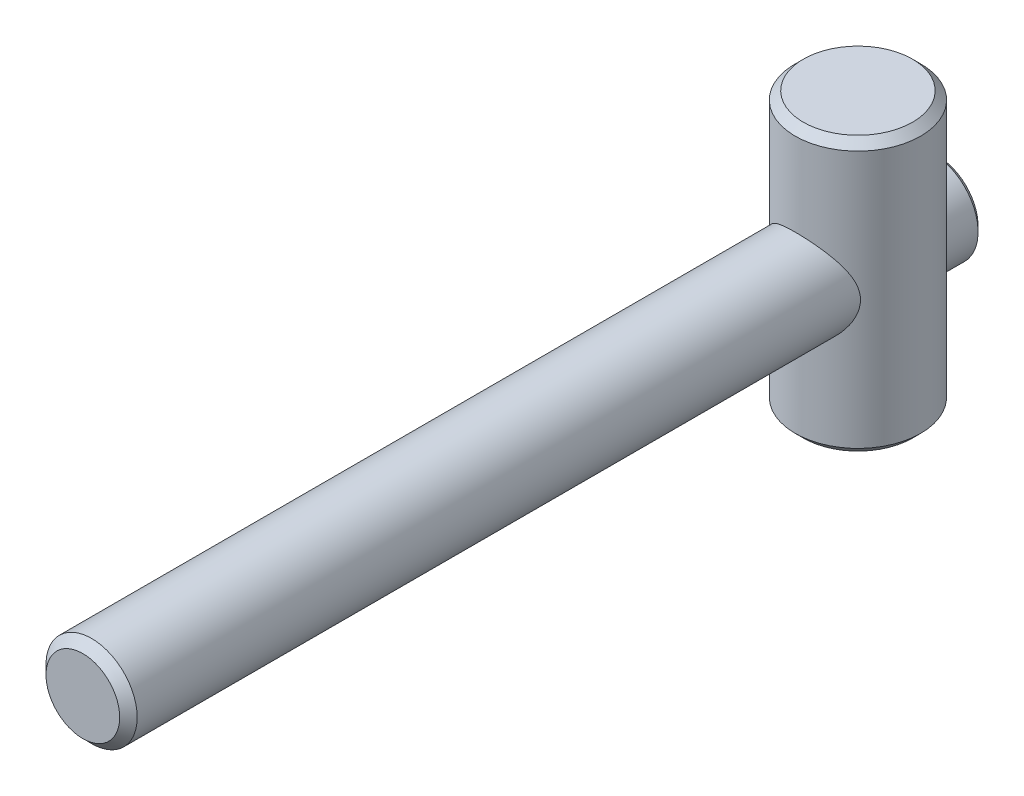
ISO-10303-21;
HEADER;
FILE_DESCRIPTION(('STEP AP214'),'2;1');
FILE_NAME('part.step','',(''),(''),'','','');
FILE_SCHEMA(('AUTOMOTIVE_DESIGN { 1 0 10303 214 1 1 1 1 }'));
ENDSEC;
DATA;
#1=APPLICATION_CONTEXT('core data for automotive mechanical design processes');
#2=APPLICATION_PROTOCOL_DEFINITION('international standard','automotive_design',2000,#1);
#3=PRODUCT_CONTEXT('',#1,'mechanical');
#4=PRODUCT('Part','Part','',(#3));
#5=PRODUCT_RELATED_PRODUCT_CATEGORY('part','',(#4));
#6=PRODUCT_DEFINITION_FORMATION('','',#4);
#7=PRODUCT_DEFINITION_CONTEXT('part definition',#1,'design');
#8=PRODUCT_DEFINITION('design','',#6,#7);
#9=PRODUCT_DEFINITION_SHAPE('','',#8);
#10=(LENGTH_UNIT() NAMED_UNIT(*) SI_UNIT(.MILLI.,.METRE.));
#11=(NAMED_UNIT(*) PLANE_ANGLE_UNIT() SI_UNIT($,.RADIAN.));
#12=(NAMED_UNIT(*) SI_UNIT($,.STERADIAN.) SOLID_ANGLE_UNIT());
#13=UNCERTAINTY_MEASURE_WITH_UNIT(LENGTH_MEASURE(1.E-05),#10,'distance_accuracy_value','');
#14=(GEOMETRIC_REPRESENTATION_CONTEXT(3) GLOBAL_UNCERTAINTY_ASSIGNED_CONTEXT((#13)) GLOBAL_UNIT_ASSIGNED_CONTEXT((#10,
#11,#12)) REPRESENTATION_CONTEXT('',''));
#15=CARTESIAN_POINT('',(0.,0.,0.));
#16=DIRECTION('',(0.,0.,1.));
#17=DIRECTION('',(1.,0.,0.));
#18=AXIS2_PLACEMENT_3D('',#15,#16,#17);
#19=CARTESIAN_POINT('',(0.,0.,-25.3));
#20=DIRECTION('',(0.,0.,1.));
#21=DIRECTION('',(1.,0.,0.));
#22=AXIS2_PLACEMENT_3D('',#19,#20,#21);
#23=PLANE('',#22);
#24=CARTESIAN_POINT('',(0.,0.,-25.3));
#25=DIRECTION('',(0.,0.,1.));
#26=DIRECTION('',(1.,0.,0.));
#27=AXIS2_PLACEMENT_3D('',#24,#25,#26);
#28=CIRCLE('',#27,3.54);
#29=CARTESIAN_POINT('',(-0.6,3.48878202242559,-25.3));
#30=VERTEX_POINT('',#29);
#31=CARTESIAN_POINT('',(-0.6,-3.48878202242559,-25.3));
#32=VERTEX_POINT('',#31);
#33=EDGE_CURVE('E239',#30,#32,#28,.T.);
#34=ORIENTED_EDGE('',*,*,#33,.F.);
#35=DIRECTION('',(0.,-1.,0.));
#36=VECTOR('',#35,1.);
#37=CARTESIAN_POINT('',(-0.6,0.,-25.3));
#38=LINE('',#37,#36);
#39=EDGE_CURVE('E228',#30,#32,#38,.T.);
#40=ORIENTED_EDGE('',*,*,#39,.T.);
#41=EDGE_LOOP('',(#34,#40));
#42=FACE_BOUND('',#41,.T.);
#43=ADVANCED_FACE('F14',(#42),#23,.F.);
#44=CARTESIAN_POINT('',(0.,0.,-25.3));
#45=DIRECTION('',(0.,0.,1.));
#46=DIRECTION('',(1.,0.,0.));
#47=AXIS2_PLACEMENT_3D('',#44,#45,#46);
#48=CONICAL_SURFACE('',#47,3.54,0.785398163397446);
#49=CARTESIAN_POINT('',(0.,0.,-24.84));
#50=DIRECTION('',(0.,0.,1.));
#51=DIRECTION('',(1.,0.,0.));
#52=AXIS2_PLACEMENT_3D('',#49,#50,#51);
#53=CIRCLE('',#52,4.);
#54=CARTESIAN_POINT('',(-0.6,3.95474398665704,-24.84));
#55=VERTEX_POINT('',#54);
#56=CARTESIAN_POINT('',(-0.6,-3.95474398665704,-24.84));
#57=VERTEX_POINT('',#56);
#58=EDGE_CURVE('E235',#55,#57,#53,.T.);
#59=ORIENTED_EDGE('',*,*,#58,.F.);
#60=CARTESIAN_POINT('',(-0.6,3.9554519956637,-24.8393));
#61=CARTESIAN_POINT('',(-0.6,3.83941046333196,-24.9540237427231));
#62=CARTESIAN_POINT('',(-0.6,3.72331727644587,-25.0686953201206));
#63=CARTESIAN_POINT('',(-0.6,3.49091447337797,-25.2979511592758));
#64=CARTESIAN_POINT('',(-0.6,3.37460477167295,-25.4125353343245));
#65=CARTESIAN_POINT('',(-0.6,3.14054409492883,-25.642725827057));
#66=CARTESIAN_POINT('',(-0.6,3.02279099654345,-25.7583299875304));
#67=CARTESIAN_POINT('',(-0.6,2.78706506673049,-25.9891808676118));
#68=CARTESIAN_POINT('',(-0.6,2.66909239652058,-26.1044277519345));
#69=CARTESIAN_POINT('',(-0.6,2.38769992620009,-26.3783597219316));
#70=CARTESIAN_POINT('',(-0.6,2.2240974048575,-26.536857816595));
#71=CARTESIAN_POINT('',(-0.6,1.97745696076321,-26.7736454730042));
#72=CARTESIAN_POINT('',(-0.6,1.89495476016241,-26.8524926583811));
#73=CARTESIAN_POINT('',(-0.6,1.72944434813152,-27.0096193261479));
#74=CARTESIAN_POINT('',(-0.6,1.64643625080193,-27.0878989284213));
#75=CARTESIAN_POINT('',(-0.6,1.48033289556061,-27.2429690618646));
#76=CARTESIAN_POINT('',(-0.6,1.39724415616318,-27.319766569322));
#77=CARTESIAN_POINT('',(-0.6,1.2297853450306,-27.4721053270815));
#78=CARTESIAN_POINT('',(-0.6,1.14541426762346,-27.5476454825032));
#79=CARTESIAN_POINT('',(-0.6,1.01743134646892,-27.6590099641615));
#80=CARTESIAN_POINT('',(-0.6,0.974611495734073,-27.6957423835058));
#81=CARTESIAN_POINT('',(-0.6,0.88825104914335,-27.7683476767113));
#82=CARTESIAN_POINT('',(-0.6,0.844710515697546,-27.8042206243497));
#83=CARTESIAN_POINT('',(-0.6,0.756681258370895,-27.8746657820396));
#84=CARTESIAN_POINT('',(-0.6,0.712193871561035,-27.9092396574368));
#85=CARTESIAN_POINT('',(-0.6,0.621791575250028,-27.9764590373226));
#86=CARTESIAN_POINT('',(-0.6,0.575877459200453,-28.0091055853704));
#87=CARTESIAN_POINT('',(-0.6,0.517059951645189,-28.0479937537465));
#88=CARTESIAN_POINT('',(-0.6,0.505142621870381,-28.0557273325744));
#89=CARTESIAN_POINT('',(-0.6,0.481156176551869,-28.0709583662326));
#90=CARTESIAN_POINT('',(-0.6,0.469087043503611,-28.0784557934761));
#91=CARTESIAN_POINT('',(-0.6,0.432629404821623,-28.1005451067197));
#92=CARTESIAN_POINT('',(-0.6,0.407992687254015,-28.1147326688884));
#93=CARTESIAN_POINT('',(-0.6,0.358127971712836,-28.1415606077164));
#94=CARTESIAN_POINT('',(-0.6,0.332906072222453,-28.1542121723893));
#95=CARTESIAN_POINT('',(-0.6,0.28159268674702,-28.1776006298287));
#96=CARTESIAN_POINT('',(-0.6,0.255501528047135,-28.1883382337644));
#97=CARTESIAN_POINT('',(-0.6,0.19385499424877,-28.2103112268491));
#98=CARTESIAN_POINT('',(-0.6,0.157946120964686,-28.2206034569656));
#99=CARTESIAN_POINT('',(-0.6,0.0849893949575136,-28.2350528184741));
#100=CARTESIAN_POINT('',(-0.6,0.0479465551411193,-28.2392338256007));
#101=CARTESIAN_POINT('',(-0.6,-0.0264554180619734,-28.2405737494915));
#102=CARTESIAN_POINT('',(-0.6,-0.0638152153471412,-28.237698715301));
#103=CARTESIAN_POINT('',(-0.6,-0.137530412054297,-28.2255268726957));
#104=CARTESIAN_POINT('',(-0.6,-0.173882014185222,-28.2162085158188));
#105=CARTESIAN_POINT('',(-0.6,-0.246261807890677,-28.1923675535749));
#106=CARTESIAN_POINT('',(-0.6,-0.282227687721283,-28.1776642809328));
#107=CARTESIAN_POINT('',(-0.6,-0.352560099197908,-28.1447807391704));
#108=CARTESIAN_POINT('',(-0.6,-0.386923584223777,-28.1265941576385));
#109=CARTESIAN_POINT('',(-0.6,-0.454569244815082,-28.0877625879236));
#110=CARTESIAN_POINT('',(-0.6,-0.487840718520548,-28.0670992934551));
#111=CARTESIAN_POINT('',(-0.6,-0.553299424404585,-28.024199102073));
#112=CARTESIAN_POINT('',(-0.6,-0.585487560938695,-28.0019635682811));
#113=CARTESIAN_POINT('',(-0.6,-0.651811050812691,-27.9544053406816));
#114=CARTESIAN_POINT('',(-0.6,-0.685873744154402,-27.928982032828));
#115=CARTESIAN_POINT('',(-0.6,-0.753285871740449,-27.8772035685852));
#116=CARTESIAN_POINT('',(-0.6,-0.786635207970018,-27.8508482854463));
#117=CARTESIAN_POINT('',(-0.6,-0.885905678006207,-27.7707557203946));
#118=CARTESIAN_POINT('',(-0.6,-0.951015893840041,-27.7160164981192));
#119=CARTESIAN_POINT('',(-0.6,-1.08003348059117,-27.6049240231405));
#120=CARTESIAN_POINT('',(-0.6,-1.14393845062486,-27.5485680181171));
#121=CARTESIAN_POINT('',(-0.6,-1.27086154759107,-27.4349047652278));
#122=CARTESIAN_POINT('',(-0.6,-1.3338799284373,-27.3775978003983));
#123=CARTESIAN_POINT('',(-0.6,-1.4591376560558,-27.2625095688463));
#124=CARTESIAN_POINT('',(-0.6,-1.52137875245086,-27.2047301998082));
#125=CARTESIAN_POINT('',(-0.6,-1.64544200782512,-27.0887149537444));
#126=CARTESIAN_POINT('',(-0.6,-1.70726413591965,-27.0304790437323));
#127=CARTESIAN_POINT('',(-0.6,-1.89214348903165,-26.8554033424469));
#128=CARTESIAN_POINT('',(-0.6,-2.01474045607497,-26.738078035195));
#129=CARTESIAN_POINT('',(-0.6,-2.28982158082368,-26.4732317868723));
#130=CARTESIAN_POINT('',(-0.6,-2.44210553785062,-26.3255035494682));
#131=CARTESIAN_POINT('',(-0.6,-2.74608630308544,-26.0293359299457));
#132=CARTESIAN_POINT('',(-0.6,-2.89778288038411,-25.8808963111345));
#133=CARTESIAN_POINT('',(-0.6,-3.20065551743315,-25.5837234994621));
#134=CARTESIAN_POINT('',(-0.6,-3.35183189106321,-25.4349906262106));
#135=CARTESIAN_POINT('',(-0.6,-3.653848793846,-25.1372979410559));
#136=CARTESIAN_POINT('',(-0.6,-3.80468942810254,-24.9883382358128));
#137=CARTESIAN_POINT('',(-0.6,-3.9554519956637,-24.8393));
#138=B_SPLINE_CURVE_WITH_KNOTS('',3,(#60,#61,#62,#63,#64,#65,#66,#67,#68,#69,#70,#71,#72,#73,
#74,#75,#76,#77,#78,#79,#80,#81,#82,#83,#84,#85,#86,#87,#88,#89,#90,#91,#92,#93,#94,#95,#96,#97,
#98,#99,#100,#101,#102,#103,#104,#105,#106,#107,#108,#109,#110,#111,#112,#113,#114,#115,#116,
#117,#118,#119,#120,#121,#122,#123,#124,#125,#126,#127,#128,#129,#130,#131,#132,#133,#134,#135,
#136,#137),.UNSPECIFIED.,.F.,.F.,(4,2,2,2,2,2,2,2,2,2,2,2,2,2,2,2,2,2,2,2,2,2,2,2,2,2,2,2,2,2,2,
2,2,2,2,2,2,2,4),(0.,0.489535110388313,0.979348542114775,1.47439453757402,1.96916156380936,
2.65251943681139,2.99487953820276,3.33716508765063,3.6765918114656,4.01630008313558,
4.18554223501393,4.35476980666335,4.5237724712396,4.69268277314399,4.73530049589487,
4.77792317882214,4.86317585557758,4.94776464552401,5.03232193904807,5.14397626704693,
5.25519319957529,5.36694631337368,5.47907498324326,5.5953739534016,5.71188570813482,
5.82931897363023,5.94665164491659,6.07414183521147,6.20164943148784,6.45678921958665,
6.71239265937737,6.96792134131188,7.22269628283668,7.47748980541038,7.98655823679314,
8.62305059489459,9.25977190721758,9.89599619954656,10.5319807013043),.UNSPECIFIED.);
#139=EDGE_CURVE('E221',#55,#30,#138,.T.);
#140=ORIENTED_EDGE('',*,*,#139,.T.);
#141=ORIENTED_EDGE('',*,*,#33,.T.);
#142=EDGE_CURVE('E229',#32,#57,#138,.T.);
#143=ORIENTED_EDGE('',*,*,#142,.T.);
#144=EDGE_LOOP('',(#59,#140,#141,#143));
#145=FACE_BOUND('',#144,.T.);
#146=ADVANCED_FACE('F215',(#145),#48,.T.);
#147=CARTESIAN_POINT('',(0.,0.,-12.8));
#148=DIRECTION('',(0.,0.,1.));
#149=DIRECTION('',(1.,0.,0.));
#150=AXIS2_PLACEMENT_3D('',#147,#148,#149);
#151=CYLINDRICAL_SURFACE('',#150,4.);
#152=CARTESIAN_POINT('',(4.,0.,-22.0749172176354));
#153=CARTESIAN_POINT('',(3.99999971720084,0.094559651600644,-22.0749177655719));
#154=CARTESIAN_POINT('',(3.99663873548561,0.189122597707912,-22.078488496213));
#155=CARTESIAN_POINT('',(3.98328406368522,0.377297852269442,-22.0925637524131));
#156=CARTESIAN_POINT('',(3.97328671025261,0.470909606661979,-22.1030721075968));
#157=CARTESIAN_POINT('',(3.94687649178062,0.65648336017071,-22.1304732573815));
#158=CARTESIAN_POINT('',(3.93044906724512,0.748441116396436,-22.1473805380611));
#159=CARTESIAN_POINT('',(3.89152450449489,0.929870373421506,-22.1867470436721));
#160=CARTESIAN_POINT('',(3.86902376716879,1.01934036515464,-22.2092095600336));
#161=CARTESIAN_POINT('',(3.79365509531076,1.28093397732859,-22.2828450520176));
#162=CARTESIAN_POINT('',(3.73252985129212,1.44885844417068,-22.3407009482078));
#163=CARTESIAN_POINT('',(3.590688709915,1.77146295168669,-22.4672506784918));
#164=CARTESIAN_POINT('',(3.50997431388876,1.92614400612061,-22.5359436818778));
#165=CARTESIAN_POINT('',(3.31318173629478,2.25065582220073,-22.6922095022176));
#166=CARTESIAN_POINT('',(3.19328494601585,2.41764951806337,-22.7808675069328));
#167=CARTESIAN_POINT('',(2.92908108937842,2.73178094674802,-22.9578760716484));
#168=CARTESIAN_POINT('',(2.78474090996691,2.87889125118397,-23.0462260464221));
#169=CARTESIAN_POINT('',(2.5362822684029,3.09553636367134,-23.1814353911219));
#170=CARTESIAN_POINT('',(2.43963284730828,3.17231415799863,-23.2305740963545));
#171=CARTESIAN_POINT('',(2.23844845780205,3.31733570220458,-23.3251054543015));
#172=CARTESIAN_POINT('',(2.13391712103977,3.38558334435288,-23.3704998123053));
#173=CARTESIAN_POINT('',(1.91752007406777,3.51266692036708,-23.4562228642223));
#174=CARTESIAN_POINT('',(1.80566515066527,3.57151627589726,-23.49655876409));
#175=CARTESIAN_POINT('',(1.57523382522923,3.67896799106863,-23.5709873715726));
#176=CARTESIAN_POINT('',(1.45666071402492,3.72757531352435,-23.6050831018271));
#177=CARTESIAN_POINT('',(1.16188171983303,3.83193503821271,-23.678830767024));
#178=CARTESIAN_POINT('',(0.982606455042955,3.88193864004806,-23.7146815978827));
#179=CARTESIAN_POINT('',(0.616370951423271,3.95663720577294,-23.7684829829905));
#180=CARTESIAN_POINT('',(0.429417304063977,3.98135342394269,-23.7864485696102));
#181=CARTESIAN_POINT('',(0.052567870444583,4.00411402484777,-23.8029868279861));
#182=CARTESIAN_POINT('',(-0.137333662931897,4.00209732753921,-23.8015150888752));
#183=CARTESIAN_POINT('',(-0.51380986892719,3.97135939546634,-23.7791958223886));
#184=CARTESIAN_POINT('',(-0.700383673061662,3.94263129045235,-23.7583433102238));
#185=CARTESIAN_POINT('',(-1.05962164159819,3.86136821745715,-23.699944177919));
#186=CARTESIAN_POINT('',(-1.23253206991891,3.80954610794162,-23.6628980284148));
#187=CARTESIAN_POINT('',(-1.56671343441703,3.68473335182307,-23.5749694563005));
#188=CARTESIAN_POINT('',(-1.72798199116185,3.61173839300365,-23.5240842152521));
#189=CARTESIAN_POINT('',(-2.05370310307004,3.43803005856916,-23.4054456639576));
#190=CARTESIAN_POINT('',(-2.2165364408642,3.33514439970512,-23.3364494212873));
#191=CARTESIAN_POINT('',(-2.52348319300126,3.10940476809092,-23.189889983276));
#192=CARTESIAN_POINT('',(-2.66757825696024,2.98653148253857,-23.1123185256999));
#193=CARTESIAN_POINT('',(-2.96150593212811,2.69807007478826,-22.9383041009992));
#194=CARTESIAN_POINT('',(-3.10726104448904,2.52879913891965,-22.8410685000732));
#195=CARTESIAN_POINT('',(-3.36953999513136,2.16705523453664,-22.6499971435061));
#196=CARTESIAN_POINT('',(-3.48605965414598,1.97457895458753,-22.556161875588));
#197=CARTESIAN_POINT('',(-3.66526169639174,1.61165125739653,-22.402032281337));
#198=CARTESIAN_POINT('',(-3.73414032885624,1.44549066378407,-22.3388789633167));
#199=CARTESIAN_POINT('',(-3.84985589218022,1.10068331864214,-22.2287430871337));
#200=CARTESIAN_POINT('',(-3.89674227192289,0.922065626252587,-22.1817243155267));
#201=CARTESIAN_POINT('',(-3.9599937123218,0.585461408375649,-22.1170906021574));
#202=CARTESIAN_POINT('',(-3.98009730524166,0.428880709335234,-22.0959235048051));
#203=CARTESIAN_POINT('',(-4.00152507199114,0.113064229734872,-22.0733369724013));
#204=CARTESIAN_POINT('',(-4.00286519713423,-0.0461691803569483,-22.0719007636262));
#205=CARTESIAN_POINT('',(-3.98669865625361,-0.362327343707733,-22.0889767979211));
#206=CARTESIAN_POINT('',(-3.96921589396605,-0.519254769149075,-22.1074637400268));
#207=CARTESIAN_POINT('',(-3.91666535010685,-0.82717652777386,-22.1614916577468));
#208=CARTESIAN_POINT('',(-3.88157034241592,-0.978161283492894,-22.1970590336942));
#209=CARTESIAN_POINT('',(-3.77812999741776,-1.33113055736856,-22.2978469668));
#210=CARTESIAN_POINT('',(-3.70207893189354,-1.52906623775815,-22.3692423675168));
#211=CARTESIAN_POINT('',(-3.52270580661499,-1.90640842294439,-22.5254840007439));
#212=CARTESIAN_POINT('',(-3.41932922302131,-2.08577687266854,-22.6103569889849));
#213=CARTESIAN_POINT('',(-3.18411833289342,-2.43025180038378,-22.7870574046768));
#214=CARTESIAN_POINT('',(-3.05152555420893,-2.59477148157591,-22.8790168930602));
#215=CARTESIAN_POINT('',(-2.76125147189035,-2.90173861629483,-23.059699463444));
#216=CARTESIAN_POINT('',(-2.6035911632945,-3.04420434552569,-23.1484251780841));
#217=CARTESIAN_POINT('',(-2.271539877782,-3.2987599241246,-23.3122631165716));
#218=CARTESIAN_POINT('',(-2.09818660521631,-3.41190835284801,-23.3878018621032));
#219=CARTESIAN_POINT('',(-1.82330793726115,-3.56180731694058,-23.4899086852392));
#220=CARTESIAN_POINT('',(-1.72916099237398,-3.6084863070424,-23.5220894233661));
#221=CARTESIAN_POINT('',(-1.53632285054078,-3.69470582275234,-23.5820343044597));
#222=CARTESIAN_POINT('',(-1.43763386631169,-3.73424977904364,-23.6098005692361));
#223=CARTESIAN_POINT('',(-1.23534308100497,-3.80598862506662,-23.6604944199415));
#224=CARTESIAN_POINT('',(-1.13170490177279,-3.83811376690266,-23.683375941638));
#225=CARTESIAN_POINT('',(-0.921160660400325,-3.89401032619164,-23.7233693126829));
#226=CARTESIAN_POINT('',(-0.81425636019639,-3.9177861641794,-23.7404842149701));
#227=CARTESIAN_POINT('',(-0.598125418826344,-3.95655048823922,-23.7684652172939));
#228=CARTESIAN_POINT('',(-0.488900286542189,-3.9715445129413,-23.7793352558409));
#229=CARTESIAN_POINT('',(-0.269138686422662,-3.9924605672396,-23.7945144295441));
#230=CARTESIAN_POINT('',(-0.15860243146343,-3.99838404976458,-23.7988246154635));
#231=CARTESIAN_POINT('',(0.0467313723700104,-4.00084937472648,-23.8006178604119));
#232=CARTESIAN_POINT('',(0.141509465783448,-3.99861635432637,-23.7989924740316));
#233=CARTESIAN_POINT('',(0.330490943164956,-3.98744748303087,-23.7908762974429));
#234=CARTESIAN_POINT('',(0.424694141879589,-3.97850957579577,-23.7843840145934));
#235=CARTESIAN_POINT('',(0.611759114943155,-3.95406659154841,-23.7666782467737));
#236=CARTESIAN_POINT('',(0.704621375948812,-3.93856396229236,-23.7554665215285));
#237=CARTESIAN_POINT('',(0.88841574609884,-3.90122128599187,-23.7285691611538));
#238=CARTESIAN_POINT('',(0.979347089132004,-3.87937877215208,-23.7128817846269));
#239=CARTESIAN_POINT('',(1.24445933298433,-3.80583624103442,-23.6603363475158));
#240=CARTESIAN_POINT('',(1.41518501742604,-3.74554675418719,-23.6175701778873));
#241=CARTESIAN_POINT('',(1.74369677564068,-3.60438289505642,-23.5191022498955));
#242=CARTESIAN_POINT('',(1.90148075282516,-3.5235051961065,-23.4633984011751));
#243=CARTESIAN_POINT('',(2.22228203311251,-3.33179335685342,-23.3343972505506));
#244=CARTESIAN_POINT('',(2.38322541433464,-3.21841054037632,-23.2597469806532));
#245=CARTESIAN_POINT('',(2.68497920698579,-2.97136345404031,-23.103106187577));
#246=CARTESIAN_POINT('',(2.82576198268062,-2.8376718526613,-23.0211058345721));
#247=CARTESIAN_POINT('',(3.03332548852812,-2.61000808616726,-22.8888332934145));
#248=CARTESIAN_POINT('',(3.10699576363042,-2.5218601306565,-22.839152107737));
#249=CARTESIAN_POINT('',(3.24665706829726,-2.3393224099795,-22.7403298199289));
#250=CARTESIAN_POINT('',(3.31264615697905,-2.24493107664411,-22.69118885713));
#251=CARTESIAN_POINT('',(3.43660180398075,-2.0501419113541,-22.5948719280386));
#252=CARTESIAN_POINT('',(3.49457298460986,-1.94974758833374,-22.5476948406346));
#253=CARTESIAN_POINT('',(3.6021255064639,-1.74306577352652,-22.4568795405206));
#254=CARTESIAN_POINT('',(3.6517073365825,-1.63677862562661,-22.4132411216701));
#255=CARTESIAN_POINT('',(3.76078752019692,-1.37275858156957,-22.3142162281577));
#256=CARTESIAN_POINT('',(3.81580236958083,-1.21205137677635,-22.2615166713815));
#257=CARTESIAN_POINT('',(3.88309107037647,-0.963817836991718,-22.1952018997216));
#258=CARTESIAN_POINT('',(3.90296834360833,-0.879972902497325,-22.1752342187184));
#259=CARTESIAN_POINT('',(3.93739985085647,-0.710192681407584,-22.1402454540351));
#260=CARTESIAN_POINT('',(3.95195647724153,-0.62425835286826,-22.1252221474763));
#261=CARTESIAN_POINT('',(3.97571410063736,-0.449073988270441,-22.1005263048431));
#262=CARTESIAN_POINT('',(3.98480070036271,-0.359792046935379,-22.0909682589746));
#263=CARTESIAN_POINT('',(3.99694447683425,-0.180341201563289,-22.0781627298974));
#264=CARTESIAN_POINT('',(4.00000026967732,-0.0901720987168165,-22.0749166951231));
#265=CARTESIAN_POINT('',(4.,0.,-22.0749172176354));
#266=B_SPLINE_CURVE_WITH_KNOTS('',3,(#152,#153,#154,#155,#156,#157,#158,#159,#160,#161,#162,
#163,#164,#165,#166,#167,#168,#169,#170,#171,#172,#173,#174,#175,#176,#177,#178,#179,#180,#181,
#182,#183,#184,#185,#186,#187,#188,#189,#190,#191,#192,#193,#194,#195,#196,#197,#198,#199,#200,
#201,#202,#203,#204,#205,#206,#207,#208,#209,#210,#211,#212,#213,#214,#215,#216,#217,#218,#219,
#220,#221,#222,#223,#224,#225,#226,#227,#228,#229,#230,#231,#232,#233,#234,#235,#236,#237,#238,
#239,#240,#241,#242,#243,#244,#245,#246,#247,#248,#249,#250,#251,#252,#253,#254,#255,#256,#257,
#258,#259,#260,#261,#262,#263,#264,#265),.UNSPECIFIED.,.T.,.F.,(4,2,2,2,2,2,2,2,2,2,2,2,2,2,2,2,
2,2,2,2,2,2,2,2,2,2,2,2,2,2,2,2,2,2,2,2,2,2,2,2,2,2,2,2,2,2,2,2,2,2,2,2,2,2,2,2,4),(0.,
0.283560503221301,0.567277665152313,0.851640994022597,1.13617321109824,1.69729774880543,
2.25837929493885,2.92774006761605,3.59801497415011,3.99610080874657,4.39400433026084,
4.79133442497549,5.18847154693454,5.75445889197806,6.31997012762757,6.88677367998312,
7.45372305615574,8.00426875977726,8.5549266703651,9.16646484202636,9.77859745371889,
10.5066073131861,11.2347211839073,11.8047550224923,12.3735009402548,12.8491941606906,
13.3244829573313,13.7991688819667,14.2745908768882,14.94214771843,15.6110467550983,
16.2999460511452,16.9882713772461,17.6463931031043,17.9757519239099,18.3049519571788,
18.6371312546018,18.9691344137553,19.3009279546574,19.6326683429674,19.9167672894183,
20.2009534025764,20.4850336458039,20.7692245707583,21.3249022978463,21.8806698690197,
22.5100347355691,23.1402542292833,23.5154020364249,23.8906444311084,24.2656695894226,
24.6406728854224,25.1720162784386,25.4371121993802,25.7020887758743,25.9724300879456,
26.24283342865),.UNSPECIFIED.);
#267=CARTESIAN_POINT('',(-0.6,3.95474398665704,-23.7671747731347));
#268=VERTEX_POINT('',#267);
#269=CARTESIAN_POINT('',(-0.6,-3.95474398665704,-23.7671747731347));
#270=VERTEX_POINT('',#269);
#271=EDGE_CURVE('E259',#268,#270,#266,.T.);
#272=ORIENTED_EDGE('',*,*,#271,.F.);
#273=DIRECTION('',(0.,0.,1.));
#274=VECTOR('',#273,1.);
#275=CARTESIAN_POINT('',(-0.6,3.95474398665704,-12.8));
#276=LINE('',#275,#274);
#277=EDGE_CURVE('E97',#268,#55,#276,.F.);
#278=ORIENTED_EDGE('',*,*,#277,.T.);
#279=ORIENTED_EDGE('',*,*,#58,.T.);
#280=DIRECTION('',(0.,0.,1.));
#281=VECTOR('',#280,1.);
#282=CARTESIAN_POINT('',(-0.6,-3.95474398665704,-12.8));
#283=LINE('',#282,#281);
#284=EDGE_CURVE('E244',#57,#270,#283,.T.);
#285=ORIENTED_EDGE('',*,*,#284,.T.);
#286=EDGE_LOOP('',(#272,#278,#279,#285));
#287=FACE_BOUND('',#286,.T.);
#288=ADVANCED_FACE('F196',(#287),#151,.T.);
#289=CARTESIAN_POINT('',(-0.6,0.,-54.8));
#290=DIRECTION('',(1.,0.,0.));
#291=DIRECTION('',(0.,-1.,0.));
#292=AXIS2_PLACEMENT_3D('',#289,#290,#291);
#293=CYLINDRICAL_SURFACE('',#292,31.5);
#294=CARTESIAN_POINT('',(0.7202,3.64052452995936,-23.5110789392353));
#295=CARTESIAN_POINT('',(0.629300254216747,3.66094254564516,-23.5134577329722));
#296=CARTESIAN_POINT('',(0.537517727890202,3.67749677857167,-23.515401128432));
#297=CARTESIAN_POINT('',(0.352855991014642,3.70277065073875,-23.5183807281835));
#298=CARTESIAN_POINT('',(0.259976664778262,3.71148945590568,-23.519416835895));
#299=CARTESIAN_POINT('',(0.0755266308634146,3.72089352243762,-23.5205345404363));
#300=CARTESIAN_POINT('',(-0.0160366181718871,3.7217239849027,-23.5206333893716));
#301=CARTESIAN_POINT('',(-0.198893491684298,3.71572448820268,-23.5199199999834));
#302=CARTESIAN_POINT('',(-0.290187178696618,3.70889647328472,-23.5191079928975));
#303=CARTESIAN_POINT('',(-0.438017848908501,3.69161294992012,-23.5170647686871));
#304=CARTESIAN_POINT('',(-0.494837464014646,3.68345523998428,-23.516102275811));
#305=CARTESIAN_POINT('',(-0.607946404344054,3.66419162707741,-23.5138403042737));
#306=CARTESIAN_POINT('',(-0.664235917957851,3.65308681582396,-23.5125409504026));
#307=CARTESIAN_POINT('',(-0.7202,3.64052452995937,-23.5110789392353));
#308=B_SPLINE_CURVE_WITH_KNOTS('',3,(#294,#295,#296,#297,#298,#299,#300,#301,#302,#303,#304,
#305,#306,#307),.UNSPECIFIED.,.F.,.F.,(4,2,2,2,2,2,4),(0.,0.279507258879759,0.559044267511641,
0.833425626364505,1.10773734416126,1.27989541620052,1.45198980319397),.UNSPECIFIED.);
#309=CARTESIAN_POINT('',(0.6,3.66517006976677,-23.5139563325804));
#310=VERTEX_POINT('',#309);
#311=CARTESIAN_POINT('',(-0.6,3.66517006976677,-23.5139563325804));
#312=VERTEX_POINT('',#311);
#313=EDGE_CURVE('E110',#310,#312,#308,.T.);
#314=ORIENTED_EDGE('',*,*,#313,.F.);
#315=CARTESIAN_POINT('',(0.6,0.,-54.8));
#316=DIRECTION('',(-1.,0.,0.));
#317=DIRECTION('',(0.,1.,0.));
#318=AXIS2_PLACEMENT_3D('',#315,#316,#317);
#319=CIRCLE('',#318,31.5);
#320=CARTESIAN_POINT('',(0.6,-3.66517006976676,-23.5139563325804));
#321=VERTEX_POINT('',#320);
#322=EDGE_CURVE('E119',#321,#310,#319,.T.);
#323=ORIENTED_EDGE('',*,*,#322,.F.);
#324=CARTESIAN_POINT('',(-0.7202,-3.64052452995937,-23.5110789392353));
#325=CARTESIAN_POINT('',(-0.629300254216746,-3.66094254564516,-23.5134577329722));
#326=CARTESIAN_POINT('',(-0.537517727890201,-3.67749677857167,-23.515401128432));
#327=CARTESIAN_POINT('',(-0.352855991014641,-3.70277065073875,-23.5183807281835));
#328=CARTESIAN_POINT('',(-0.259976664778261,-3.71148945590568,-23.519416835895));
#329=CARTESIAN_POINT('',(-0.0755266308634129,-3.72089352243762,-23.5205345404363));
#330=CARTESIAN_POINT('',(0.0160366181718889,-3.7217239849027,-23.5206333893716));
#331=CARTESIAN_POINT('',(0.1988934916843,-3.71572448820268,-23.5199199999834));
#332=CARTESIAN_POINT('',(0.29018717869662,-3.70889647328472,-23.5191079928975));
#333=CARTESIAN_POINT('',(0.438017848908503,-3.69161294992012,-23.5170647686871));
#334=CARTESIAN_POINT('',(0.494837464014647,-3.68345523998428,-23.516102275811));
#335=CARTESIAN_POINT('',(0.607946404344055,-3.66419162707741,-23.5138403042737));
#336=CARTESIAN_POINT('',(0.664235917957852,-3.65308681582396,-23.5125409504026));
#337=CARTESIAN_POINT('',(0.7202,-3.64052452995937,-23.5110789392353));
#338=B_SPLINE_CURVE_WITH_KNOTS('',3,(#324,#325,#326,#327,#328,#329,#330,#331,#332,#333,#334,
#335,#336,#337),.UNSPECIFIED.,.F.,.F.,(4,2,2,2,2,2,4),(0.,0.279507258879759,0.559044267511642,
0.833425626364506,1.10773734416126,1.27989541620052,1.45198980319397),.UNSPECIFIED.);
#339=CARTESIAN_POINT('',(-0.6,-3.66517006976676,-23.5139563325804));
#340=VERTEX_POINT('',#339);
#341=EDGE_CURVE('E102',#340,#321,#338,.T.);
#342=ORIENTED_EDGE('',*,*,#341,.F.);
#343=CARTESIAN_POINT('',(-0.6,0.,-54.8));
#344=DIRECTION('',(-1.,0.,0.));
#345=DIRECTION('',(0.,1.,0.));
#346=AXIS2_PLACEMENT_3D('',#343,#344,#345);
#347=CIRCLE('',#346,31.5);
#348=EDGE_CURVE('E19',#340,#312,#347,.T.);
#349=ORIENTED_EDGE('',*,*,#348,.T.);
#350=EDGE_LOOP('',(#314,#323,#342,#349));
#351=FACE_BOUND('',#350,.T.);
#352=ADVANCED_FACE('F191',(#351),#293,.F.);
#353=DIRECTION('',(0.,-1.,0.));
#354=VECTOR('',#353,1.);
#355=CARTESIAN_POINT('',(0.6,0.,-25.3));
#356=LINE('',#355,#354);
#357=CARTESIAN_POINT('',(0.6,3.48878202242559,-25.3));
#358=VERTEX_POINT('',#357);
#359=CARTESIAN_POINT('',(0.6,-3.48878202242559,-25.3));
#360=VERTEX_POINT('',#359);
#361=EDGE_CURVE('E212',#358,#360,#356,.T.);
#362=ORIENTED_EDGE('',*,*,#361,.F.);
#363=EDGE_CURVE('E236',#360,#358,#28,.T.);
#364=ORIENTED_EDGE('',*,*,#363,.F.);
#365=EDGE_LOOP('',(#362,#364));
#366=FACE_BOUND('',#365,.T.);
#367=ADVANCED_FACE('F195',(#366),#23,.F.);
#368=CARTESIAN_POINT('',(0.6,3.9554519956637,-24.8393));
#369=CARTESIAN_POINT('',(0.6,3.83941046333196,-24.9540237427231));
#370=CARTESIAN_POINT('',(0.6,3.72331727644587,-25.0686953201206));
#371=CARTESIAN_POINT('',(0.6,3.49091447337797,-25.2979511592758));
#372=CARTESIAN_POINT('',(0.6,3.37460477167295,-25.4125353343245));
#373=CARTESIAN_POINT('',(0.6,3.14054409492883,-25.642725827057));
#374=CARTESIAN_POINT('',(0.6,3.02279099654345,-25.7583299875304));
#375=CARTESIAN_POINT('',(0.6,2.78706506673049,-25.9891808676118));
#376=CARTESIAN_POINT('',(0.6,2.66909239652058,-26.1044277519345));
#377=CARTESIAN_POINT('',(0.6,2.38769992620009,-26.3783597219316));
#378=CARTESIAN_POINT('',(0.6,2.2240974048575,-26.536857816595));
#379=CARTESIAN_POINT('',(0.6,1.97745696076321,-26.7736454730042));
#380=CARTESIAN_POINT('',(0.6,1.89495476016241,-26.8524926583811));
#381=CARTESIAN_POINT('',(0.6,1.72944434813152,-27.0096193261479));
#382=CARTESIAN_POINT('',(0.6,1.64643625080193,-27.0878989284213));
#383=CARTESIAN_POINT('',(0.6,1.48033289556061,-27.2429690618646));
#384=CARTESIAN_POINT('',(0.6,1.39724415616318,-27.319766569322));
#385=CARTESIAN_POINT('',(0.6,1.2297853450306,-27.4721053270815));
#386=CARTESIAN_POINT('',(0.6,1.14541426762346,-27.5476454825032));
#387=CARTESIAN_POINT('',(0.6,1.01743134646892,-27.6590099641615));
#388=CARTESIAN_POINT('',(0.6,0.974611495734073,-27.6957423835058));
#389=CARTESIAN_POINT('',(0.6,0.88825104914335,-27.7683476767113));
#390=CARTESIAN_POINT('',(0.6,0.844710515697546,-27.8042206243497));
#391=CARTESIAN_POINT('',(0.6,0.756681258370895,-27.8746657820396));
#392=CARTESIAN_POINT('',(0.6,0.712193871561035,-27.9092396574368));
#393=CARTESIAN_POINT('',(0.6,0.621791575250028,-27.9764590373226));
#394=CARTESIAN_POINT('',(0.6,0.575877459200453,-28.0091055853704));
#395=CARTESIAN_POINT('',(0.6,0.517059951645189,-28.0479937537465));
#396=CARTESIAN_POINT('',(0.6,0.505142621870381,-28.0557273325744));
#397=CARTESIAN_POINT('',(0.6,0.481156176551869,-28.0709583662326));
#398=CARTESIAN_POINT('',(0.6,0.469087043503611,-28.0784557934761));
#399=CARTESIAN_POINT('',(0.6,0.432629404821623,-28.1005451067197));
#400=CARTESIAN_POINT('',(0.6,0.407992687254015,-28.1147326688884));
#401=CARTESIAN_POINT('',(0.6,0.358127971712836,-28.1415606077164));
#402=CARTESIAN_POINT('',(0.6,0.332906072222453,-28.1542121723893));
#403=CARTESIAN_POINT('',(0.6,0.28159268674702,-28.1776006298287));
#404=CARTESIAN_POINT('',(0.6,0.255501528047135,-28.1883382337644));
#405=CARTESIAN_POINT('',(0.6,0.19385499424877,-28.2103112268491));
#406=CARTESIAN_POINT('',(0.6,0.157946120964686,-28.2206034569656));
#407=CARTESIAN_POINT('',(0.6,0.0849893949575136,-28.2350528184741));
#408=CARTESIAN_POINT('',(0.6,0.0479465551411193,-28.2392338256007));
#409=CARTESIAN_POINT('',(0.6,-0.0264554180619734,-28.2405737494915));
#410=CARTESIAN_POINT('',(0.6,-0.0638152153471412,-28.237698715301));
#411=CARTESIAN_POINT('',(0.6,-0.137530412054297,-28.2255268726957));
#412=CARTESIAN_POINT('',(0.6,-0.173882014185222,-28.2162085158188));
#413=CARTESIAN_POINT('',(0.6,-0.246261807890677,-28.1923675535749));
#414=CARTESIAN_POINT('',(0.6,-0.282227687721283,-28.1776642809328));
#415=CARTESIAN_POINT('',(0.6,-0.352560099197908,-28.1447807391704));
#416=CARTESIAN_POINT('',(0.6,-0.386923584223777,-28.1265941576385));
#417=CARTESIAN_POINT('',(0.6,-0.454569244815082,-28.0877625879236));
#418=CARTESIAN_POINT('',(0.6,-0.487840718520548,-28.0670992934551));
#419=CARTESIAN_POINT('',(0.6,-0.553299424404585,-28.024199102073));
#420=CARTESIAN_POINT('',(0.6,-0.585487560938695,-28.0019635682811));
#421=CARTESIAN_POINT('',(0.6,-0.651811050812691,-27.9544053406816));
#422=CARTESIAN_POINT('',(0.6,-0.685873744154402,-27.928982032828));
#423=CARTESIAN_POINT('',(0.6,-0.753285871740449,-27.8772035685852));
#424=CARTESIAN_POINT('',(0.6,-0.786635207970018,-27.8508482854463));
#425=CARTESIAN_POINT('',(0.6,-0.885905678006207,-27.7707557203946));
#426=CARTESIAN_POINT('',(0.6,-0.951015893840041,-27.7160164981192));
#427=CARTESIAN_POINT('',(0.6,-1.08003348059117,-27.6049240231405));
#428=CARTESIAN_POINT('',(0.6,-1.14393845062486,-27.5485680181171));
#429=CARTESIAN_POINT('',(0.6,-1.27086154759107,-27.4349047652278));
#430=CARTESIAN_POINT('',(0.6,-1.3338799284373,-27.3775978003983));
#431=CARTESIAN_POINT('',(0.6,-1.4591376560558,-27.2625095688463));
#432=CARTESIAN_POINT('',(0.6,-1.52137875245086,-27.2047301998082));
#433=CARTESIAN_POINT('',(0.6,-1.64544200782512,-27.0887149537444));
#434=CARTESIAN_POINT('',(0.6,-1.70726413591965,-27.0304790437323));
#435=CARTESIAN_POINT('',(0.6,-1.89214348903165,-26.8554033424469));
#436=CARTESIAN_POINT('',(0.6,-2.01474045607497,-26.738078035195));
#437=CARTESIAN_POINT('',(0.6,-2.28982158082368,-26.4732317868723));
#438=CARTESIAN_POINT('',(0.6,-2.44210553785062,-26.3255035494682));
#439=CARTESIAN_POINT('',(0.6,-2.74608630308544,-26.0293359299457));
#440=CARTESIAN_POINT('',(0.6,-2.89778288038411,-25.8808963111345));
#441=CARTESIAN_POINT('',(0.6,-3.20065551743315,-25.5837234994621));
#442=CARTESIAN_POINT('',(0.6,-3.35183189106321,-25.4349906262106));
#443=CARTESIAN_POINT('',(0.6,-3.653848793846,-25.1372979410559));
#444=CARTESIAN_POINT('',(0.6,-3.80468942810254,-24.9883382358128));
#445=CARTESIAN_POINT('',(0.6,-3.9554519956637,-24.8393));
#446=B_SPLINE_CURVE_WITH_KNOTS('',3,(#368,#369,#370,#371,#372,#373,#374,#375,#376,#377,#378,
#379,#380,#381,#382,#383,#384,#385,#386,#387,#388,#389,#390,#391,#392,#393,#394,#395,#396,#397,
#398,#399,#400,#401,#402,#403,#404,#405,#406,#407,#408,#409,#410,#411,#412,#413,#414,#415,#416,
#417,#418,#419,#420,#421,#422,#423,#424,#425,#426,#427,#428,#429,#430,#431,#432,#433,#434,#435,
#436,#437,#438,#439,#440,#441,#442,#443,#444,#445),.UNSPECIFIED.,.F.,.F.,(4,2,2,2,2,2,2,2,2,2,2,
2,2,2,2,2,2,2,2,2,2,2,2,2,2,2,2,2,2,2,2,2,2,2,2,2,2,2,4),(0.,0.489535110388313,
0.979348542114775,1.47439453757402,1.96916156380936,2.65251943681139,2.99487953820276,
3.33716508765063,3.6765918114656,4.01630008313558,4.18554223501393,4.35476980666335,
4.5237724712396,4.69268277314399,4.73530049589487,4.77792317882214,4.86317585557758,
4.94776464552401,5.03232193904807,5.14397626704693,5.25519319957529,5.36694631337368,
5.47907498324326,5.5953739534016,5.71188570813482,5.82931897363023,5.94665164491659,
6.07414183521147,6.20164943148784,6.45678921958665,6.71239265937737,6.96792134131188,
7.22269628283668,7.47748980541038,7.98655823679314,8.62305059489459,9.25977190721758,
9.89599619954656,10.5319807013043),.UNSPECIFIED.);
#447=CARTESIAN_POINT('',(0.6,3.95474398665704,-24.84));
#448=VERTEX_POINT('',#447);
#449=EDGE_CURVE('E36',#448,#358,#446,.T.);
#450=ORIENTED_EDGE('',*,*,#449,.F.);
#451=CARTESIAN_POINT('',(0.6,-3.95474398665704,-24.84));
#452=VERTEX_POINT('',#451);
#453=EDGE_CURVE('E232',#452,#448,#53,.T.);
#454=ORIENTED_EDGE('',*,*,#453,.F.);
#455=EDGE_CURVE('E213',#360,#452,#446,.T.);
#456=ORIENTED_EDGE('',*,*,#455,.F.);
#457=ORIENTED_EDGE('',*,*,#363,.T.);
#458=EDGE_LOOP('',(#450,#454,#456,#457));
#459=FACE_BOUND('',#458,.T.);
#460=ADVANCED_FACE('F219',(#459),#48,.T.);
#461=CARTESIAN_POINT('',(0.6,-3.95474398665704,-23.7671747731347));
#462=VERTEX_POINT('',#461);
#463=CARTESIAN_POINT('',(0.6,3.95474398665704,-23.7671747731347));
#464=VERTEX_POINT('',#463);
#465=EDGE_CURVE('E263',#462,#464,#266,.T.);
#466=ORIENTED_EDGE('',*,*,#465,.F.);
#467=DIRECTION('',(0.,0.,1.));
#468=VECTOR('',#467,1.);
#469=CARTESIAN_POINT('',(0.6,-3.95474398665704,-12.8));
#470=LINE('',#469,#468);
#471=EDGE_CURVE('E242',#452,#462,#470,.T.);
#472=ORIENTED_EDGE('',*,*,#471,.F.);
#473=ORIENTED_EDGE('',*,*,#453,.T.);
#474=DIRECTION('',(0.,0.,1.));
#475=VECTOR('',#474,1.);
#476=CARTESIAN_POINT('',(0.6,3.95474398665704,-12.8));
#477=LINE('',#476,#475);
#478=EDGE_CURVE('E32',#464,#448,#477,.F.);
#479=ORIENTED_EDGE('',*,*,#478,.F.);
#480=EDGE_LOOP('',(#466,#472,#473,#479));
#481=FACE_BOUND('',#480,.T.);
#482=ADVANCED_FACE('F203',(#481),#151,.T.);
#483=CARTESIAN_POINT('',(0.6,0.,-54.8));
#484=DIRECTION('',(-1.,0.,0.));
#485=DIRECTION('',(0.,1.,0.));
#486=AXIS2_PLACEMENT_3D('',#483,#484,#485);
#487=PLANE('',#486);
#488=CARTESIAN_POINT('',(0.6,5.24144856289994,-25.0756784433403));
#489=CARTESIAN_POINT('',(0.6,4.98335054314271,-24.8193092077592));
#490=CARTESIAN_POINT('',(0.6,4.72517898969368,-24.5630130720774));
#491=CARTESIAN_POINT('',(0.6,4.20843297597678,-24.0508330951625));
#492=CARTESIAN_POINT('',(0.6,3.94985852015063,-23.7949492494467));
#493=CARTESIAN_POINT('',(0.6,3.56149681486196,-23.411626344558));
#494=CARTESIAN_POINT('',(0.6,3.43195870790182,-23.2839350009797));
#495=CARTESIAN_POINT('',(0.6,3.17264289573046,-23.0287963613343));
#496=CARTESIAN_POINT('',(0.6,3.04286519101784,-22.9013490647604));
#497=CARTESIAN_POINT('',(0.6,2.78297398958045,-22.6467936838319));
#498=CARTESIAN_POINT('',(0.6,2.65286048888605,-22.5196856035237));
#499=CARTESIAN_POINT('',(0.6,2.39209410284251,-22.2660223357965));
#500=CARTESIAN_POINT('',(0.6,2.26144121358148,-22.139467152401));
#501=CARTESIAN_POINT('',(0.6,2.13041700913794,-22.0132954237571));
#502=B_SPLINE_CURVE_WITH_KNOTS('',3,(#488,#489,#490,#491,#492,#493,#494,#495,#496,#497,#498,
#499,#500,#501),.UNSPECIFIED.,.F.,.F.,(4,2,2,2,2,2,4),(0.,1.09135708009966,2.18270221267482,
2.72838208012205,3.27406081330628,3.81974602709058,4.36543520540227),.UNSPECIFIED.);
#503=CARTESIAN_POINT('',(0.6,3.92153996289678,-23.7671747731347));
#504=VERTEX_POINT('',#503);
#505=EDGE_CURVE('E169',#504,#310,#502,.T.);
#506=ORIENTED_EDGE('',*,*,#505,.F.);
#507=DIRECTION('',(0.,1.,0.));
#508=VECTOR('',#507,1.);
#509=CARTESIAN_POINT('',(0.6,12.,-23.7671747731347));
#510=LINE('',#509,#508);
#511=EDGE_CURVE('E117',#504,#464,#510,.T.);
#512=ORIENTED_EDGE('',*,*,#511,.T.);
#513=ORIENTED_EDGE('',*,*,#478,.T.);
#514=ORIENTED_EDGE('',*,*,#449,.T.);
#515=ORIENTED_EDGE('',*,*,#361,.T.);
#516=ORIENTED_EDGE('',*,*,#455,.T.);
#517=ORIENTED_EDGE('',*,*,#471,.T.);
#518=CARTESIAN_POINT('',(0.6,-3.92153996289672,-23.7671747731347));
#519=VERTEX_POINT('',#518);
#520=EDGE_CURVE('E248',#462,#519,#510,.T.);
#521=ORIENTED_EDGE('',*,*,#520,.T.);
#522=CARTESIAN_POINT('',(0.6,-2.13041700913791,-22.0132954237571));
#523=CARTESIAN_POINT('',(0.6,-2.20825937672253,-22.088230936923));
#524=CARTESIAN_POINT('',(0.6,-2.2859592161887,-22.1633140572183));
#525=CARTESIAN_POINT('',(0.6,-2.44113254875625,-22.3137133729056));
#526=CARTESIAN_POINT('',(0.6,-2.51860604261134,-22.3890295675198));
#527=CARTESIAN_POINT('',(0.6,-2.75077459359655,-22.6152340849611));
#528=CARTESIAN_POINT('',(0.6,-2.90521897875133,-22.7663795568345));
#529=CARTESIAN_POINT('',(0.6,-3.21369228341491,-23.06908955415));
#530=CARTESIAN_POINT('',(0.6,-3.36772120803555,-23.2206540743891));
#531=CARTESIAN_POINT('',(0.6,-3.67550250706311,-23.524064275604));
#532=CARTESIAN_POINT('',(0.6,-3.82925488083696,-23.6759099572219));
#533=CARTESIAN_POINT('',(0.6,-4.19294614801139,-24.0355407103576));
#534=CARTESIAN_POINT('',(0.6,-4.40280249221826,-24.2434092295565));
#535=CARTESIAN_POINT('',(0.6,-4.82227635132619,-24.6593903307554));
#536=CARTESIAN_POINT('',(0.6,-5.03189386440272,-24.8675029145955));
#537=CARTESIAN_POINT('',(0.6,-5.24144856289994,-25.0756784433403));
#538=B_SPLINE_CURVE_WITH_KNOTS('',3,(#522,#523,#524,#525,#526,#527,#528,#529,#530,#531,#532,
#533,#534,#535,#536,#537),.UNSPECIFIED.,.F.,.F.,(4,2,2,2,2,2,2,4),(0.,0.324148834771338,
0.64829658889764,1.29658684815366,1.94486909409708,2.59315282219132,3.47929086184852,
4.36543562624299),.UNSPECIFIED.);
#539=EDGE_CURVE('E160',#321,#519,#538,.T.);
#540=ORIENTED_EDGE('',*,*,#539,.F.);
#541=ORIENTED_EDGE('',*,*,#322,.T.);
#542=EDGE_LOOP('',(#506,#512,#513,#514,#515,#516,#517,#521,#540,#541));
#543=FACE_BOUND('',#542,.T.);
#544=ADVANCED_FACE('F199',(#543),#487,.T.);
#545=CARTESIAN_POINT('',(-0.6,0.,-54.8));
#546=DIRECTION('',(-1.,0.,0.));
#547=DIRECTION('',(0.,1.,0.));
#548=AXIS2_PLACEMENT_3D('',#545,#546,#547);
#549=PLANE('',#548);
#550=DIRECTION('',(0.,1.,0.));
#551=VECTOR('',#550,1.);
#552=CARTESIAN_POINT('',(-0.6,12.,-23.7671747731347));
#553=LINE('',#552,#551);
#554=CARTESIAN_POINT('',(-0.6,3.92153996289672,-23.7671747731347));
#555=VERTEX_POINT('',#554);
#556=EDGE_CURVE('E91',#555,#268,#553,.T.);
#557=ORIENTED_EDGE('',*,*,#556,.F.);
#558=CARTESIAN_POINT('',(-0.6,5.24144856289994,-25.0756784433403));
#559=CARTESIAN_POINT('',(-0.6,4.98335054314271,-24.8193092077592));
#560=CARTESIAN_POINT('',(-0.6,4.72517898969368,-24.5630130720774));
#561=CARTESIAN_POINT('',(-0.6,4.20843297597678,-24.0508330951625));
#562=CARTESIAN_POINT('',(-0.6,3.94985852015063,-23.7949492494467));
#563=CARTESIAN_POINT('',(-0.6,3.56149681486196,-23.411626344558));
#564=CARTESIAN_POINT('',(-0.6,3.43195870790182,-23.2839350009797));
#565=CARTESIAN_POINT('',(-0.6,3.17264289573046,-23.0287963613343));
#566=CARTESIAN_POINT('',(-0.6,3.04286519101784,-22.9013490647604));
#567=CARTESIAN_POINT('',(-0.6,2.78297398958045,-22.6467936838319));
#568=CARTESIAN_POINT('',(-0.6,2.65286048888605,-22.5196856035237));
#569=CARTESIAN_POINT('',(-0.6,2.39209410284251,-22.2660223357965));
#570=CARTESIAN_POINT('',(-0.6,2.26144121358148,-22.1394671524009));
#571=CARTESIAN_POINT('',(-0.6,2.13041700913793,-22.0132954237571));
#572=B_SPLINE_CURVE_WITH_KNOTS('',3,(#558,#559,#560,#561,#562,#563,#564,#565,#566,#567,#568,
#569,#570,#571),.UNSPECIFIED.,.F.,.F.,(4,2,2,2,2,2,4),(0.,1.09135708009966,2.18270221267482,
2.72838208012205,3.27406081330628,3.81974602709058,4.36543520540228),.UNSPECIFIED.);
#573=EDGE_CURVE('E94',#555,#312,#572,.T.);
#574=ORIENTED_EDGE('',*,*,#573,.T.);
#575=ORIENTED_EDGE('',*,*,#348,.F.);
#576=CARTESIAN_POINT('',(-0.6,-2.13041700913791,-22.0132954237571));
#577=CARTESIAN_POINT('',(-0.6,-2.20825937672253,-22.088230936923));
#578=CARTESIAN_POINT('',(-0.6,-2.2859592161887,-22.1633140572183));
#579=CARTESIAN_POINT('',(-0.6,-2.44113254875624,-22.3137133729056));
#580=CARTESIAN_POINT('',(-0.6,-2.51860604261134,-22.3890295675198));
#581=CARTESIAN_POINT('',(-0.6,-2.75077459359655,-22.6152340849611));
#582=CARTESIAN_POINT('',(-0.6,-2.90521897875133,-22.7663795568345));
#583=CARTESIAN_POINT('',(-0.6,-3.21369228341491,-23.06908955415));
#584=CARTESIAN_POINT('',(-0.6,-3.36772120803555,-23.2206540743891));
#585=CARTESIAN_POINT('',(-0.6,-3.67550250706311,-23.524064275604));
#586=CARTESIAN_POINT('',(-0.6,-3.82925488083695,-23.6759099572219));
#587=CARTESIAN_POINT('',(-0.6,-4.19294614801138,-24.0355407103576));
#588=CARTESIAN_POINT('',(-0.6,-4.40280249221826,-24.2434092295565));
#589=CARTESIAN_POINT('',(-0.6,-4.82227635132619,-24.6593903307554));
#590=CARTESIAN_POINT('',(-0.6,-5.03189386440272,-24.8675029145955));
#591=CARTESIAN_POINT('',(-0.6,-5.24144856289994,-25.0756784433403));
#592=B_SPLINE_CURVE_WITH_KNOTS('',3,(#576,#577,#578,#579,#580,#581,#582,#583,#584,#585,#586,
#587,#588,#589,#590,#591),.UNSPECIFIED.,.F.,.F.,(4,2,2,2,2,2,2,4),(0.,0.324148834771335,
0.648296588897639,1.29658684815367,1.94486909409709,2.59315282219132,3.47929086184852,
4.36543562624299),.UNSPECIFIED.);
#593=CARTESIAN_POINT('',(-0.6,-3.92153996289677,-23.7671747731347));
#594=VERTEX_POINT('',#593);
#595=EDGE_CURVE('E175',#340,#594,#592,.T.);
#596=ORIENTED_EDGE('',*,*,#595,.T.);
#597=EDGE_CURVE('E104',#270,#594,#553,.T.);
#598=ORIENTED_EDGE('',*,*,#597,.F.);
#599=ORIENTED_EDGE('',*,*,#284,.F.);
#600=ORIENTED_EDGE('',*,*,#142,.F.);
#601=ORIENTED_EDGE('',*,*,#39,.F.);
#602=ORIENTED_EDGE('',*,*,#139,.F.);
#603=ORIENTED_EDGE('',*,*,#277,.F.);
#604=EDGE_LOOP('',(#557,#574,#575,#596,#598,#599,#600,#601,#602,#603));
#605=FACE_BOUND('',#604,.T.);
#606=ADVANCED_FACE('F16',(#605),#549,.F.);
#607=CARTESIAN_POINT('',(4.,0.,-14.5250827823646));
#608=CARTESIAN_POINT('',(3.99999971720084,-0.0945596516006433,-14.5250822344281));
#609=CARTESIAN_POINT('',(3.99663873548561,-0.189122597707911,-14.521511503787));
#610=CARTESIAN_POINT('',(3.98328406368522,-0.37729785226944,-14.5074362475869));
#611=CARTESIAN_POINT('',(3.97328671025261,-0.470909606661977,-14.4969278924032));
#612=CARTESIAN_POINT('',(3.94687649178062,-0.65648336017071,-14.4695267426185));
#613=CARTESIAN_POINT('',(3.93044906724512,-0.748441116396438,-14.4526194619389));
#614=CARTESIAN_POINT('',(3.89152450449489,-0.929870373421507,-14.4132529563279));
#615=CARTESIAN_POINT('',(3.86902376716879,-1.01934036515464,-14.3907904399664));
#616=CARTESIAN_POINT('',(3.79365509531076,-1.28093397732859,-14.3171549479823));
#617=CARTESIAN_POINT('',(3.73252985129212,-1.44885844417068,-14.2592990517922));
#618=CARTESIAN_POINT('',(3.590688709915,-1.7714629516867,-14.1327493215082));
#619=CARTESIAN_POINT('',(3.50997431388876,-1.92614400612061,-14.0640563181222));
#620=CARTESIAN_POINT('',(3.31318173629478,-2.25065582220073,-13.9077904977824));
#621=CARTESIAN_POINT('',(3.19328494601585,-2.41764951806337,-13.8191324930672));
#622=CARTESIAN_POINT('',(2.92908108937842,-2.73178094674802,-13.6421239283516));
#623=CARTESIAN_POINT('',(2.78474090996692,-2.87889125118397,-13.5537739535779));
#624=CARTESIAN_POINT('',(2.53628226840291,-3.09553636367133,-13.4185646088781));
#625=CARTESIAN_POINT('',(2.43963284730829,-3.17231415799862,-13.3694259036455));
#626=CARTESIAN_POINT('',(2.23844845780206,-3.31733570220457,-13.2748945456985));
#627=CARTESIAN_POINT('',(2.13391712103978,-3.38558334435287,-13.2295001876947));
#628=CARTESIAN_POINT('',(1.91752007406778,-3.51266692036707,-13.1437771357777));
#629=CARTESIAN_POINT('',(1.80566515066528,-3.57151627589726,-13.10344123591));
#630=CARTESIAN_POINT('',(1.57523382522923,-3.67896799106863,-13.0290126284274));
#631=CARTESIAN_POINT('',(1.45666071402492,-3.72757531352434,-12.9949168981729));
#632=CARTESIAN_POINT('',(1.16188171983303,-3.83193503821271,-12.921169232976));
#633=CARTESIAN_POINT('',(0.982606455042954,-3.88193864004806,-12.8853184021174));
#634=CARTESIAN_POINT('',(0.616370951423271,-3.95663720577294,-12.8315170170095));
#635=CARTESIAN_POINT('',(0.429417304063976,-3.98135342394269,-12.8135514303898));
#636=CARTESIAN_POINT('',(0.0525678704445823,-4.00411402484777,-12.7970131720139));
#637=CARTESIAN_POINT('',(-0.137333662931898,-4.00209732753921,-12.7984849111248));
#638=CARTESIAN_POINT('',(-0.51380986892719,-3.97135939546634,-12.8208041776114));
#639=CARTESIAN_POINT('',(-0.700383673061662,-3.94263129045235,-12.8416566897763));
#640=CARTESIAN_POINT('',(-1.05962164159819,-3.86136821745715,-12.900055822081));
#641=CARTESIAN_POINT('',(-1.23253206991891,-3.80954610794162,-12.9371019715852));
#642=CARTESIAN_POINT('',(-1.56671343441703,-3.68473335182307,-13.0250305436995));
#643=CARTESIAN_POINT('',(-1.72798199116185,-3.61173839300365,-13.0759157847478));
#644=CARTESIAN_POINT('',(-2.05370310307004,-3.43803005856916,-13.1945543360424));
#645=CARTESIAN_POINT('',(-2.2165364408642,-3.33514439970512,-13.2635505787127));
#646=CARTESIAN_POINT('',(-2.52348319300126,-3.10940476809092,-13.410110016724));
#647=CARTESIAN_POINT('',(-2.66757825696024,-2.98653148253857,-13.4876814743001));
#648=CARTESIAN_POINT('',(-2.96150593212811,-2.69807007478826,-13.6616958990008));
#649=CARTESIAN_POINT('',(-3.10726104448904,-2.52879913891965,-13.7589314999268));
#650=CARTESIAN_POINT('',(-3.36953999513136,-2.16705523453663,-13.9500028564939));
#651=CARTESIAN_POINT('',(-3.48605965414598,-1.97457895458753,-14.043838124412));
#652=CARTESIAN_POINT('',(-3.66526169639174,-1.61165125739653,-14.197967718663));
#653=CARTESIAN_POINT('',(-3.73414032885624,-1.44549066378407,-14.2611210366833));
#654=CARTESIAN_POINT('',(-3.84985589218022,-1.10068331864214,-14.3712569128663));
#655=CARTESIAN_POINT('',(-3.8967422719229,-0.922065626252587,-14.4182756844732));
#656=CARTESIAN_POINT('',(-3.95999371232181,-0.585461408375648,-14.4829093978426));
#657=CARTESIAN_POINT('',(-3.98009730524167,-0.428880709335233,-14.5040764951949));
#658=CARTESIAN_POINT('',(-4.00152507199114,-0.113064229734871,-14.5266630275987));
#659=CARTESIAN_POINT('',(-4.00286519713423,0.0461691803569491,-14.5280992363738));
#660=CARTESIAN_POINT('',(-3.98669865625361,0.362327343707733,-14.5110232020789));
#661=CARTESIAN_POINT('',(-3.96921589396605,0.519254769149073,-14.4925362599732));
#662=CARTESIAN_POINT('',(-3.91666535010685,0.827176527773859,-14.4385083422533));
#663=CARTESIAN_POINT('',(-3.88157034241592,0.978161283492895,-14.4029409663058));
#664=CARTESIAN_POINT('',(-3.77812999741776,1.33113055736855,-14.3021530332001));
#665=CARTESIAN_POINT('',(-3.70207893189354,1.52906623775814,-14.2307576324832));
#666=CARTESIAN_POINT('',(-3.522705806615,1.90640842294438,-14.0745159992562));
#667=CARTESIAN_POINT('',(-3.41932922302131,2.08577687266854,-13.9896430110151));
#668=CARTESIAN_POINT('',(-3.18411833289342,2.43025180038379,-13.8129425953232));
#669=CARTESIAN_POINT('',(-3.05152555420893,2.59477148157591,-13.7209831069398));
#670=CARTESIAN_POINT('',(-2.76125147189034,2.90173861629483,-13.540300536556));
#671=CARTESIAN_POINT('',(-2.6035911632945,3.04420434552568,-13.4515748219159));
#672=CARTESIAN_POINT('',(-2.271539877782,3.2987599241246,-13.2877368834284));
#673=CARTESIAN_POINT('',(-2.09818660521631,3.41190835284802,-13.2121981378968));
#674=CARTESIAN_POINT('',(-1.82330793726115,3.56180731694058,-13.1100913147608));
#675=CARTESIAN_POINT('',(-1.72916099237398,3.6084863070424,-13.0779105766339));
#676=CARTESIAN_POINT('',(-1.53632285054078,3.69470582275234,-13.0179656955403));
#677=CARTESIAN_POINT('',(-1.43763386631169,3.73424977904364,-12.990199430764));
#678=CARTESIAN_POINT('',(-1.23534308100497,3.80598862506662,-12.9395055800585));
#679=CARTESIAN_POINT('',(-1.13170490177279,3.83811376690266,-12.916624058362));
#680=CARTESIAN_POINT('',(-0.921160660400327,3.89401032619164,-12.8766306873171));
#681=CARTESIAN_POINT('',(-0.814256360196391,3.9177861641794,-12.8595157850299));
#682=CARTESIAN_POINT('',(-0.598125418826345,3.95655048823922,-12.8315347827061));
#683=CARTESIAN_POINT('',(-0.488900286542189,3.9715445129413,-12.8206647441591));
#684=CARTESIAN_POINT('',(-0.269138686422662,3.9924605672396,-12.8054855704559));
#685=CARTESIAN_POINT('',(-0.158602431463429,3.99838404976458,-12.8011753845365));
#686=CARTESIAN_POINT('',(0.046731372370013,4.00084937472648,-12.7993821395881));
#687=CARTESIAN_POINT('',(0.141509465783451,3.99861635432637,-12.8010075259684));
#688=CARTESIAN_POINT('',(0.330490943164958,3.98744748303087,-12.8091237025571));
#689=CARTESIAN_POINT('',(0.424694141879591,3.97850957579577,-12.8156159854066));
#690=CARTESIAN_POINT('',(0.611759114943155,3.95406659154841,-12.8333217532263));
#691=CARTESIAN_POINT('',(0.704621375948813,3.93856396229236,-12.8445334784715));
#692=CARTESIAN_POINT('',(0.88841574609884,3.90122128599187,-12.8714308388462));
#693=CARTESIAN_POINT('',(0.979347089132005,3.87937877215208,-12.8871182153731));
#694=CARTESIAN_POINT('',(1.24445933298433,3.80583624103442,-12.9396636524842));
#695=CARTESIAN_POINT('',(1.41518501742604,3.74554675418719,-12.9824298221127));
#696=CARTESIAN_POINT('',(1.74369677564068,3.60438289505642,-13.0808977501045));
#697=CARTESIAN_POINT('',(1.90148075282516,3.5235051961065,-13.1366015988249));
#698=CARTESIAN_POINT('',(2.22228203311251,3.33179335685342,-13.2656027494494));
#699=CARTESIAN_POINT('',(2.38322541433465,3.21841054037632,-13.3402530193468));
#700=CARTESIAN_POINT('',(2.68497920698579,2.97136345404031,-13.496893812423));
#701=CARTESIAN_POINT('',(2.82576198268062,2.8376718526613,-13.5788941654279));
#702=CARTESIAN_POINT('',(3.03332548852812,2.61000808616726,-13.7111667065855));
#703=CARTESIAN_POINT('',(3.10699576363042,2.5218601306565,-13.760847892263));
#704=CARTESIAN_POINT('',(3.24665706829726,2.33932240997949,-13.8596701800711));
#705=CARTESIAN_POINT('',(3.31264615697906,2.24493107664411,-13.9088111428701));
#706=CARTESIAN_POINT('',(3.43660180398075,2.05014191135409,-14.0051280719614));
#707=CARTESIAN_POINT('',(3.49457298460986,1.94974758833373,-14.0523051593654));
#708=CARTESIAN_POINT('',(3.60212550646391,1.74306577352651,-14.1431204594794));
#709=CARTESIAN_POINT('',(3.65170733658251,1.6367786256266,-14.18675887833));
#710=CARTESIAN_POINT('',(3.76078752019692,1.37275858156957,-14.2857837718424));
#711=CARTESIAN_POINT('',(3.81580236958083,1.21205137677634,-14.3384833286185));
#712=CARTESIAN_POINT('',(3.88309107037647,0.963817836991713,-14.4047981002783));
#713=CARTESIAN_POINT('',(3.90296834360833,0.879972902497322,-14.4247657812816));
#714=CARTESIAN_POINT('',(3.93739985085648,0.71019268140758,-14.4597545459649));
#715=CARTESIAN_POINT('',(3.95195647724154,0.624258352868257,-14.4747778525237));
#716=CARTESIAN_POINT('',(3.97571410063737,0.449073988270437,-14.4994736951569));
#717=CARTESIAN_POINT('',(3.98480070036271,0.359792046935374,-14.5090317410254));
#718=CARTESIAN_POINT('',(3.99694447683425,0.180341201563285,-14.5218372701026));
#719=CARTESIAN_POINT('',(4.00000026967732,0.0901720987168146,-14.525083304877));
#720=CARTESIAN_POINT('',(4.,0.,-14.5250827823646));
#721=B_SPLINE_CURVE_WITH_KNOTS('',3,(#607,#608,#609,#610,#611,#612,#613,#614,#615,#616,#617,
#618,#619,#620,#621,#622,#623,#624,#625,#626,#627,#628,#629,#630,#631,#632,#633,#634,#635,#636,
#637,#638,#639,#640,#641,#642,#643,#644,#645,#646,#647,#648,#649,#650,#651,#652,#653,#654,#655,
#656,#657,#658,#659,#660,#661,#662,#663,#664,#665,#666,#667,#668,#669,#670,#671,#672,#673,#674,
#675,#676,#677,#678,#679,#680,#681,#682,#683,#684,#685,#686,#687,#688,#689,#690,#691,#692,#693,
#694,#695,#696,#697,#698,#699,#700,#701,#702,#703,#704,#705,#706,#707,#708,#709,#710,#711,#712,
#713,#714,#715,#716,#717,#718,#719,#720),.UNSPECIFIED.,.T.,.F.,(4,2,2,2,2,2,2,2,2,2,2,2,2,2,2,2,
2,2,2,2,2,2,2,2,2,2,2,2,2,2,2,2,2,2,2,2,2,2,2,2,2,2,2,2,2,2,2,2,2,2,2,2,2,2,2,2,4),(0.,
0.2835605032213,0.567277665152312,0.851640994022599,1.13617321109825,1.69729774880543,
2.25837929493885,2.92774006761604,3.59801497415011,3.99610080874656,4.39400433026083,
4.79133442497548,5.18847154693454,5.75445889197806,6.31997012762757,6.88677367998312,
7.45372305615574,8.00426875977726,8.5549266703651,9.16646484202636,9.77859745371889,
10.5066073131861,11.2347211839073,11.8047550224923,12.3735009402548,12.8491941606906,
13.3244829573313,13.7991688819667,14.2745908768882,14.94214771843,15.6110467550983,
16.2999460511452,16.9882713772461,17.6463931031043,17.9757519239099,18.3049519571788,
18.6371312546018,18.9691344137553,19.3009279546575,19.6326683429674,19.9167672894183,
20.2009534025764,20.4850336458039,20.7692245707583,21.3249022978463,21.8806698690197,
22.5100347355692,23.1402542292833,23.5154020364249,23.8906444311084,24.2656695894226,
24.6406728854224,25.1720162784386,25.4371121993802,25.7020887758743,25.9724300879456,
26.24283342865),.UNSPECIFIED.);
#722=CARTESIAN_POINT('',(4.,0.,-14.5250827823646));
#723=VERTEX_POINT('',#722);
#724=EDGE_CURVE('E185',#723,#723,#721,.T.);
#725=ORIENTED_EDGE('',*,*,#724,.F.);
#726=EDGE_LOOP('',(#725));
#727=FACE_BOUND('',#726,.T.);
#728=CARTESIAN_POINT('',(0.,0.,48.933));
#729=DIRECTION('',(0.,0.,1.));
#730=DIRECTION('',(1.,0.,0.));
#731=AXIS2_PLACEMENT_3D('',#728,#729,#730);
#732=CIRCLE('',#731,4.);
#733=CARTESIAN_POINT('',(4.,0.,48.933));
#734=VERTEX_POINT('',#733);
#735=EDGE_CURVE('E264',#734,#734,#732,.T.);
#736=ORIENTED_EDGE('',*,*,#735,.F.);
#737=EDGE_LOOP('',(#736));
#738=FACE_BOUND('',#737,.T.);
#739=ADVANCED_FACE('F277',(#727,#738),#151,.T.);
#740=CARTESIAN_POINT('',(0.,-12.,-18.3));
#741=DIRECTION('',(0.,1.,0.));
#742=DIRECTION('',(1.,0.,0.));
#743=AXIS2_PLACEMENT_3D('',#740,#741,#742);
#744=PLANE('',#743);
#745=CARTESIAN_POINT('',(0.,-12.,-18.3));
#746=DIRECTION('',(0.,1.,0.));
#747=DIRECTION('',(1.,0.,0.));
#748=AXIS2_PLACEMENT_3D('',#745,#746,#747);
#749=CIRCLE('',#748,4.79289321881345);
#750=CARTESIAN_POINT('',(4.79289321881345,-12.,-18.3));
#751=VERTEX_POINT('',#750);
#752=EDGE_CURVE('E122',#751,#751,#749,.T.);
#753=ORIENTED_EDGE('',*,*,#752,.F.);
#754=EDGE_LOOP('',(#753));
#755=FACE_BOUND('',#754,.T.);
#756=ADVANCED_FACE('F286',(#755),#744,.F.);
#757=CARTESIAN_POINT('',(0.,12.,-23.0928932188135));
#758=DIRECTION('',(0.,-1.,0.));
#759=DIRECTION('',(-1.,0.,0.));
#760=AXIS2_PLACEMENT_3D('',#757,#758,#759);
#761=PLANE('',#760);
#762=CARTESIAN_POINT('',(0.,12.,-18.3));
#763=DIRECTION('',(0.,1.,0.));
#764=DIRECTION('',(1.,0.,0.));
#765=AXIS2_PLACEMENT_3D('',#762,#763,#764);
#766=CIRCLE('',#765,4.79289321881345);
#767=CARTESIAN_POINT('',(4.79289321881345,12.,-18.3));
#768=VERTEX_POINT('',#767);
#769=EDGE_CURVE('E9',#768,#768,#766,.T.);
#770=ORIENTED_EDGE('',*,*,#769,.T.);
#771=EDGE_LOOP('',(#770));
#772=FACE_BOUND('',#771,.T.);
#773=ADVANCED_FACE('F152',(#772),#761,.F.);
#774=CARTESIAN_POINT('',(0.,-12.,-18.3));
#775=DIRECTION('',(0.,1.,0.));
#776=DIRECTION('',(1.,0.,0.));
#777=AXIS2_PLACEMENT_3D('',#774,#775,#776);
#778=CONICAL_SURFACE('',#777,4.79289321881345,0.78539816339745);
#779=CARTESIAN_POINT('',(0.,-11.2928932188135,-18.3));
#780=DIRECTION('',(0.,1.,0.));
#781=DIRECTION('',(1.,0.,0.));
#782=AXIS2_PLACEMENT_3D('',#779,#780,#781);
#783=CIRCLE('',#782,5.5);
#784=CARTESIAN_POINT('',(5.5,-11.2928932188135,-18.3));
#785=VERTEX_POINT('',#784);
#786=EDGE_CURVE('E308',#785,#785,#783,.T.);
#787=ORIENTED_EDGE('',*,*,#786,.F.);
#788=EDGE_LOOP('',(#787));
#789=FACE_BOUND('',#788,.T.);
#790=ORIENTED_EDGE('',*,*,#752,.T.);
#791=EDGE_LOOP('',(#790));
#792=FACE_BOUND('',#791,.T.);
#793=ADVANCED_FACE('F294',(#789,#792),#778,.T.);
#794=CARTESIAN_POINT('',(0.,11.2928932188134,-18.3));
#795=DIRECTION('',(0.,-1.,0.));
#796=DIRECTION('',(-1.,0.,0.));
#797=AXIS2_PLACEMENT_3D('',#794,#795,#796);
#798=CONICAL_SURFACE('',#797,5.5,0.785398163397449);
#799=ORIENTED_EDGE('',*,*,#769,.F.);
#800=EDGE_LOOP('',(#799));
#801=FACE_BOUND('',#800,.T.);
#802=CARTESIAN_POINT('',(0.,11.2928932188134,-18.3));
#803=DIRECTION('',(0.,1.,0.));
#804=DIRECTION('',(1.,0.,0.));
#805=AXIS2_PLACEMENT_3D('',#802,#803,#804);
#806=CIRCLE('',#805,5.5);
#807=CARTESIAN_POINT('',(5.5,11.2928932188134,-18.3));
#808=VERTEX_POINT('',#807);
#809=EDGE_CURVE('E24',#808,#808,#806,.T.);
#810=ORIENTED_EDGE('',*,*,#809,.T.);
#811=EDGE_LOOP('',(#810));
#812=FACE_BOUND('',#811,.T.);
#813=ADVANCED_FACE('F298',(#801,#812),#798,.T.);
#814=CARTESIAN_POINT('',(0.,12.,-18.3));
#815=DIRECTION('',(0.,1.,0.));
#816=DIRECTION('',(1.,0.,0.));
#817=AXIS2_PLACEMENT_3D('',#814,#815,#816);
#818=CYLINDRICAL_SURFACE('',#817,5.5);
#819=ORIENTED_EDGE('',*,*,#809,.F.);
#820=EDGE_LOOP('',(#819));
#821=FACE_BOUND('',#820,.T.);
#822=ORIENTED_EDGE('',*,*,#786,.T.);
#823=EDGE_LOOP('',(#822));
#824=FACE_BOUND('',#823,.T.);
#825=ORIENTED_EDGE('',*,*,#271,.T.);
#826=ORIENTED_EDGE('',*,*,#597,.T.);
#827=CARTESIAN_POINT('',(2.17144416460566,-2.81248297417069,-23.3532));
#828=CARTESIAN_POINT('',(2.0690833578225,-2.94700705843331,-23.3971442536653));
#829=CARTESIAN_POINT('',(1.95731490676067,-3.07515187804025,-23.4415267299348));
#830=CARTESIAN_POINT('',(1.7139524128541,-3.31452488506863,-23.5277451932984));
#831=CARTESIAN_POINT('',(1.58217918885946,-3.42557978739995,-23.5695528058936));
#832=CARTESIAN_POINT('',(1.32837400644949,-3.6037499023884,-23.6384435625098));
#833=CARTESIAN_POINT('',(1.20977987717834,-3.67520879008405,-23.6667936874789));
#834=CARTESIAN_POINT('',(0.962048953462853,-3.79911511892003,-23.716673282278));
#835=CARTESIAN_POINT('',(0.832947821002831,-3.85162383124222,-23.7382247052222));
#836=CARTESIAN_POINT('',(0.565167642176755,-3.93463497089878,-23.7725623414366));
#837=CARTESIAN_POINT('',(0.426406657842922,-3.96491514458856,-23.7852599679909));
#838=CARTESIAN_POINT('',(0.145054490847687,-3.99975612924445,-23.7998860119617));
#839=CARTESIAN_POINT('',(0.00246399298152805,-4.00432150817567,-23.8018163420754));
#840=CARTESIAN_POINT('',(-0.262063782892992,-3.98843613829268,-23.7951349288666));
#841=CARTESIAN_POINT('',(-0.384245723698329,-3.97120385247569,-23.7878793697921));
#842=CARTESIAN_POINT('',(-0.623772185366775,-3.91837802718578,-23.7658368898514));
#843=CARTESIAN_POINT('',(-0.741117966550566,-3.88278930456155,-23.751051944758));
#844=CARTESIAN_POINT('',(-0.970983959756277,-3.79456515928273,-23.7148909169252));
#845=CARTESIAN_POINT('',(-1.08334691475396,-3.74158084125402,-23.6933804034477));
#846=CARTESIAN_POINT('',(-1.29927135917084,-3.62137345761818,-23.6454803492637));
#847=CARTESIAN_POINT('',(-1.40281265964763,-3.5541188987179,-23.6190800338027));
#848=CARTESIAN_POINT('',(-1.62977930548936,-3.38608908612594,-23.5546775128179));
#849=CARTESIAN_POINT('',(-1.7498929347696,-3.28130382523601,-23.5155665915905));
#850=CARTESIAN_POINT('',(-1.97310720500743,-3.05696742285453,-23.4352436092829));
#851=CARTESIAN_POINT('',(-2.07631088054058,-2.93751410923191,-23.3940464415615));
#852=CARTESIAN_POINT('',(-2.17144416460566,-2.81248297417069,-23.3532));
#853=B_SPLINE_CURVE_WITH_KNOTS('',3,(#827,#828,#829,#830,#831,#832,#833,#834,#835,#836,#837,
#838,#839,#840,#841,#842,#843,#844,#845,#846,#847,#848,#849,#850,#851,#852),.UNSPECIFIED.,.F.,
.F.,(4,2,2,2,2,2,2,2,2,2,2,2,4),(0.,0.524750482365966,1.05451352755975,1.47691569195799,
1.89793961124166,2.32311787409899,2.74822060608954,3.11728330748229,3.48624921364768,
3.86312036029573,4.24083204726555,4.73148267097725,5.21902256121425),.UNSPECIFIED.);
#854=EDGE_CURVE('E118',#519,#594,#853,.T.);
#855=ORIENTED_EDGE('',*,*,#854,.F.);
#856=ORIENTED_EDGE('',*,*,#520,.F.);
#857=ORIENTED_EDGE('',*,*,#465,.T.);
#858=ORIENTED_EDGE('',*,*,#511,.F.);
#859=CARTESIAN_POINT('',(-2.17144416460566,2.81248297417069,-23.3532));
#860=CARTESIAN_POINT('',(-2.0690833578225,2.94700705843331,-23.3971442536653));
#861=CARTESIAN_POINT('',(-1.95731490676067,3.07515187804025,-23.4415267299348));
#862=CARTESIAN_POINT('',(-1.7139524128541,3.31452488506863,-23.5277451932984));
#863=CARTESIAN_POINT('',(-1.58217918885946,3.42557978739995,-23.5695528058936));
#864=CARTESIAN_POINT('',(-1.32837400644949,3.6037499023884,-23.6384435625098));
#865=CARTESIAN_POINT('',(-1.20977987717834,3.67520879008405,-23.6667936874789));
#866=CARTESIAN_POINT('',(-0.962048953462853,3.79911511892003,-23.716673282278));
#867=CARTESIAN_POINT('',(-0.832947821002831,3.85162383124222,-23.7382247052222));
#868=CARTESIAN_POINT('',(-0.565167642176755,3.93463497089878,-23.7725623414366));
#869=CARTESIAN_POINT('',(-0.426406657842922,3.96491514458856,-23.7852599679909));
#870=CARTESIAN_POINT('',(-0.145054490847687,3.99975612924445,-23.7998860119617));
#871=CARTESIAN_POINT('',(-0.00246399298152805,4.00432150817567,-23.8018163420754));
#872=CARTESIAN_POINT('',(0.262063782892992,3.98843613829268,-23.7951349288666));
#873=CARTESIAN_POINT('',(0.384245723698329,3.97120385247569,-23.7878793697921));
#874=CARTESIAN_POINT('',(0.623772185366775,3.91837802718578,-23.7658368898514));
#875=CARTESIAN_POINT('',(0.741117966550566,3.88278930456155,-23.751051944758));
#876=CARTESIAN_POINT('',(0.970983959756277,3.79456515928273,-23.7148909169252));
#877=CARTESIAN_POINT('',(1.08334691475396,3.74158084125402,-23.6933804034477));
#878=CARTESIAN_POINT('',(1.29927135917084,3.62137345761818,-23.6454803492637));
#879=CARTESIAN_POINT('',(1.40281265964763,3.5541188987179,-23.6190800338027));
#880=CARTESIAN_POINT('',(1.62977930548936,3.38608908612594,-23.5546775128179));
#881=CARTESIAN_POINT('',(1.7498929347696,3.28130382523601,-23.5155665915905));
#882=CARTESIAN_POINT('',(1.97310720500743,3.05696742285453,-23.4352436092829));
#883=CARTESIAN_POINT('',(2.07631088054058,2.93751410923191,-23.3940464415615));
#884=CARTESIAN_POINT('',(2.17144416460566,2.81248297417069,-23.3532));
#885=B_SPLINE_CURVE_WITH_KNOTS('',3,(#859,#860,#861,#862,#863,#864,#865,#866,#867,#868,#869,
#870,#871,#872,#873,#874,#875,#876,#877,#878,#879,#880,#881,#882,#883,#884),.UNSPECIFIED.,.F.,
.F.,(4,2,2,2,2,2,2,2,2,2,2,2,4),(0.,0.524750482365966,1.05451352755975,1.47691569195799,
1.89793961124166,2.32311787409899,2.74822060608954,3.11728330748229,3.48624921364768,
3.86312036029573,4.24083204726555,4.73148267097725,5.21902256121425),.UNSPECIFIED.);
#886=EDGE_CURVE('E108',#555,#504,#885,.T.);
#887=ORIENTED_EDGE('',*,*,#886,.F.);
#888=ORIENTED_EDGE('',*,*,#556,.T.);
#889=EDGE_LOOP('',(#825,#826,#855,#856,#857,#858,#887,#888));
#890=FACE_BOUND('',#889,.T.);
#891=ORIENTED_EDGE('',*,*,#724,.T.);
#892=EDGE_LOOP('',(#891));
#893=FACE_BOUND('',#892,.T.);
#894=ADVANCED_FACE('F114',(#821,#824,#890,#893),#818,.T.);
#895=CARTESIAN_POINT('',(0.,0.,-23.8));
#896=DIRECTION('',(0.,0.,-1.));
#897=DIRECTION('',(-1.,0.,0.));
#898=AXIS2_PLACEMENT_3D('',#895,#896,#897);
#899=CONICAL_SURFACE('',#898,4.,0.785398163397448);
#900=ORIENTED_EDGE('',*,*,#595,.F.);
#901=ORIENTED_EDGE('',*,*,#341,.T.);
#902=ORIENTED_EDGE('',*,*,#539,.T.);
#903=ORIENTED_EDGE('',*,*,#854,.T.);
#904=EDGE_LOOP('',(#900,#901,#902,#903));
#905=FACE_BOUND('',#904,.T.);
#906=ADVANCED_FACE('F151',(#905),#899,.F.);
#907=ORIENTED_EDGE('',*,*,#573,.F.);
#908=ORIENTED_EDGE('',*,*,#886,.T.);
#909=ORIENTED_EDGE('',*,*,#505,.T.);
#910=ORIENTED_EDGE('',*,*,#313,.T.);
#911=EDGE_LOOP('',(#907,#908,#909,#910));
#912=FACE_BOUND('',#911,.T.);
#913=ADVANCED_FACE('F107',(#912),#899,.F.);
#914=CARTESIAN_POINT('',(3.233,0.,49.7));
#915=DIRECTION('',(0.,0.,-1.));
#916=DIRECTION('',(-1.,0.,0.));
#917=AXIS2_PLACEMENT_3D('',#914,#915,#916);
#918=PLANE('',#917);
#919=CARTESIAN_POINT('',(0.,0.,49.7));
#920=DIRECTION('',(0.,0.,1.));
#921=DIRECTION('',(1.,0.,0.));
#922=AXIS2_PLACEMENT_3D('',#919,#920,#921);
#923=CIRCLE('',#922,3.233);
#924=CARTESIAN_POINT('',(3.233,0.,49.7));
#925=VERTEX_POINT('',#924);
#926=EDGE_CURVE('E266',#925,#925,#923,.T.);
#927=ORIENTED_EDGE('',*,*,#926,.T.);
#928=EDGE_LOOP('',(#927));
#929=FACE_BOUND('',#928,.T.);
#930=ADVANCED_FACE('F150',(#929),#918,.F.);
#931=CARTESIAN_POINT('',(0.,0.,48.933));
#932=DIRECTION('',(0.,0.,-1.));
#933=DIRECTION('',(-1.,0.,0.));
#934=AXIS2_PLACEMENT_3D('',#931,#932,#933);
#935=CONICAL_SURFACE('',#934,4.,0.785398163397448);
#936=ORIENTED_EDGE('',*,*,#926,.F.);
#937=EDGE_LOOP('',(#936));
#938=FACE_BOUND('',#937,.T.);
#939=ORIENTED_EDGE('',*,*,#735,.T.);
#940=EDGE_LOOP('',(#939));
#941=FACE_BOUND('',#940,.T.);
#942=ADVANCED_FACE('F274',(#938,#941),#935,.T.);
#943=CLOSED_SHELL('',(#43,#146,#288,#352,#367,#460,#482,#544,#606,#739,#756,#773,#793,#813,#894,
#906,#913,#930,#942));
#944=MANIFOLD_SOLID_BREP('B1',#943);
#945=ADVANCED_BREP_SHAPE_REPRESENTATION('',(#18,#944),#14);
#946=SHAPE_DEFINITION_REPRESENTATION(#9,#945);
ENDSEC;
END-ISO-10303-21;
